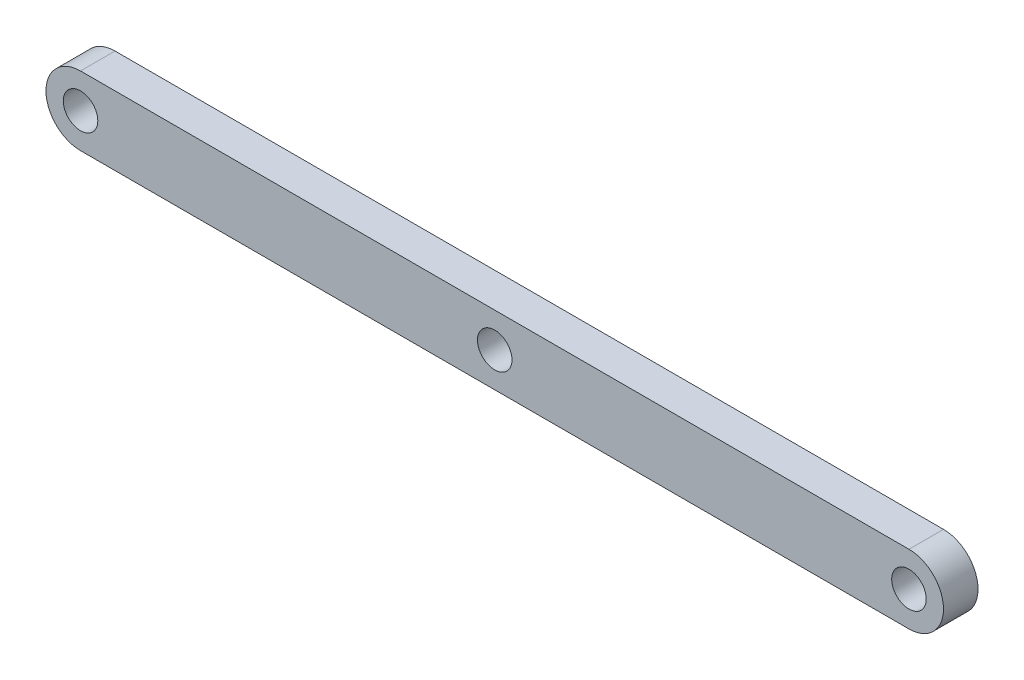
ISO-10303-21;
HEADER;
FILE_DESCRIPTION(('STEP AP214'),'2;1');
FILE_NAME('part.step','',(''),(''),'','','');
FILE_SCHEMA(('AUTOMOTIVE_DESIGN { 1 0 10303 214 1 1 1 1 }'));
ENDSEC;
DATA;
#1=APPLICATION_CONTEXT('core data for automotive mechanical design processes');
#2=APPLICATION_PROTOCOL_DEFINITION('international standard','automotive_design',2000,#1);
#3=PRODUCT_CONTEXT('',#1,'mechanical');
#4=PRODUCT('Part','Part','',(#3));
#5=PRODUCT_RELATED_PRODUCT_CATEGORY('part','',(#4));
#6=PRODUCT_DEFINITION_FORMATION('','',#4);
#7=PRODUCT_DEFINITION_CONTEXT('part definition',#1,'design');
#8=PRODUCT_DEFINITION('design','',#6,#7);
#9=PRODUCT_DEFINITION_SHAPE('','',#8);
#10=(LENGTH_UNIT() NAMED_UNIT(*) SI_UNIT(.MILLI.,.METRE.));
#11=(NAMED_UNIT(*) PLANE_ANGLE_UNIT() SI_UNIT($,.RADIAN.));
#12=(NAMED_UNIT(*) SI_UNIT($,.STERADIAN.) SOLID_ANGLE_UNIT());
#13=UNCERTAINTY_MEASURE_WITH_UNIT(LENGTH_MEASURE(1.E-05),#10,'distance_accuracy_value','');
#14=(GEOMETRIC_REPRESENTATION_CONTEXT(3) GLOBAL_UNCERTAINTY_ASSIGNED_CONTEXT((#13)) GLOBAL_UNIT_ASSIGNED_CONTEXT((#10,
#11,#12)) REPRESENTATION_CONTEXT('',''));
#15=CARTESIAN_POINT('',(0.,0.,0.));
#16=DIRECTION('',(0.,0.,1.));
#17=DIRECTION('',(1.,0.,0.));
#18=AXIS2_PLACEMENT_3D('',#15,#16,#17);
#19=CARTESIAN_POINT('',(0.,0.,3.175));
#20=DIRECTION('',(0.,0.,1.));
#21=DIRECTION('',(1.,0.,0.));
#22=AXIS2_PLACEMENT_3D('',#19,#20,#21);
#23=PLANE('',#22);
#24=CARTESIAN_POINT('',(76.2,0.,3.175));
#25=DIRECTION('',(0.,0.,1.));
#26=DIRECTION('',(1.,0.,0.));
#27=AXIS2_PLACEMENT_3D('',#24,#25,#26);
#28=CIRCLE('',#27,1.5875);
#29=CARTESIAN_POINT('',(77.7875,0.,3.175));
#30=VERTEX_POINT('',#29);
#31=EDGE_CURVE('E115',#30,#30,#28,.T.);
#32=ORIENTED_EDGE('',*,*,#31,.F.);
#33=EDGE_LOOP('',(#32));
#34=FACE_BOUND('',#33,.T.);
#35=CARTESIAN_POINT('',(0.,0.,3.175));
#36=DIRECTION('',(0.,0.,1.));
#37=DIRECTION('',(1.,0.,0.));
#38=AXIS2_PLACEMENT_3D('',#35,#36,#37);
#39=CIRCLE('',#38,3.175);
#40=CARTESIAN_POINT('',(0.,3.175,3.175));
#41=VERTEX_POINT('',#40);
#42=CARTESIAN_POINT('',(0.,-3.175,3.175));
#43=VERTEX_POINT('',#42);
#44=EDGE_CURVE('E85',#41,#43,#39,.T.);
#45=ORIENTED_EDGE('',*,*,#44,.T.);
#46=DIRECTION('',(1.,0.,0.));
#47=VECTOR('',#46,1.);
#48=CARTESIAN_POINT('',(0.,-3.175,3.175));
#49=LINE('',#48,#47);
#50=CARTESIAN_POINT('',(76.2,-3.175,3.175));
#51=VERTEX_POINT('',#50);
#52=EDGE_CURVE('E80',#43,#51,#49,.T.);
#53=ORIENTED_EDGE('',*,*,#52,.T.);
#54=CARTESIAN_POINT('',(76.2,0.,3.175));
#55=DIRECTION('',(0.,0.,1.));
#56=DIRECTION('',(1.,0.,0.));
#57=AXIS2_PLACEMENT_3D('',#54,#55,#56);
#58=CIRCLE('',#57,3.175);
#59=CARTESIAN_POINT('',(76.2,3.175,3.175));
#60=VERTEX_POINT('',#59);
#61=EDGE_CURVE('E83',#51,#60,#58,.T.);
#62=ORIENTED_EDGE('',*,*,#61,.T.);
#63=DIRECTION('',(-1.,0.,0.));
#64=VECTOR('',#63,1.);
#65=CARTESIAN_POINT('',(0.,3.175,3.175));
#66=LINE('',#65,#64);
#67=EDGE_CURVE('E50',#60,#41,#66,.T.);
#68=ORIENTED_EDGE('',*,*,#67,.T.);
#69=EDGE_LOOP('',(#45,#53,#62,#68));
#70=FACE_BOUND('',#69,.T.);
#71=CARTESIAN_POINT('',(0.,0.,3.175));
#72=DIRECTION('',(0.,0.,1.));
#73=DIRECTION('',(1.,0.,0.));
#74=AXIS2_PLACEMENT_3D('',#71,#72,#73);
#75=CIRCLE('',#74,1.5875);
#76=CARTESIAN_POINT('',(1.5875,0.,3.175));
#77=VERTEX_POINT('',#76);
#78=EDGE_CURVE('E100',#77,#77,#75,.T.);
#79=ORIENTED_EDGE('',*,*,#78,.F.);
#80=EDGE_LOOP('',(#79));
#81=FACE_BOUND('',#80,.T.);
#82=CARTESIAN_POINT('',(38.1,0.,3.175));
#83=DIRECTION('',(0.,0.,1.));
#84=DIRECTION('',(1.,0.,0.));
#85=AXIS2_PLACEMENT_3D('',#82,#83,#84);
#86=CIRCLE('',#85,1.5875);
#87=CARTESIAN_POINT('',(39.6875,0.,3.175));
#88=VERTEX_POINT('',#87);
#89=EDGE_CURVE('E121',#88,#88,#86,.T.);
#90=ORIENTED_EDGE('',*,*,#89,.F.);
#91=EDGE_LOOP('',(#90));
#92=FACE_BOUND('',#91,.T.);
#93=ADVANCED_FACE('F33',(#34,#70,#81,#92),#23,.T.);
#94=CARTESIAN_POINT('',(0.,0.,0.));
#95=DIRECTION('',(0.,0.,1.));
#96=DIRECTION('',(1.,0.,0.));
#97=AXIS2_PLACEMENT_3D('',#94,#95,#96);
#98=PLANE('',#97);
#99=CARTESIAN_POINT('',(0.,0.,0.));
#100=DIRECTION('',(0.,0.,1.));
#101=DIRECTION('',(1.,0.,0.));
#102=AXIS2_PLACEMENT_3D('',#99,#100,#101);
#103=CIRCLE('',#102,3.175);
#104=CARTESIAN_POINT('',(0.,3.175,0.));
#105=VERTEX_POINT('',#104);
#106=CARTESIAN_POINT('',(0.,-3.175,0.));
#107=VERTEX_POINT('',#106);
#108=EDGE_CURVE('E97',#105,#107,#103,.T.);
#109=ORIENTED_EDGE('',*,*,#108,.F.);
#110=DIRECTION('',(-1.,0.,0.));
#111=VECTOR('',#110,1.);
#112=CARTESIAN_POINT('',(0.,3.175,0.));
#113=LINE('',#112,#111);
#114=CARTESIAN_POINT('',(76.2,3.175,0.));
#115=VERTEX_POINT('',#114);
#116=EDGE_CURVE('E73',#115,#105,#113,.T.);
#117=ORIENTED_EDGE('',*,*,#116,.F.);
#118=CARTESIAN_POINT('',(76.2,0.,0.));
#119=DIRECTION('',(0.,0.,1.));
#120=DIRECTION('',(1.,0.,0.));
#121=AXIS2_PLACEMENT_3D('',#118,#119,#120);
#122=CIRCLE('',#121,3.175);
#123=CARTESIAN_POINT('',(76.2,-3.175,0.));
#124=VERTEX_POINT('',#123);
#125=EDGE_CURVE('E67',#124,#115,#122,.T.);
#126=ORIENTED_EDGE('',*,*,#125,.F.);
#127=DIRECTION('',(1.,0.,0.));
#128=VECTOR('',#127,1.);
#129=CARTESIAN_POINT('',(0.,-3.175,0.));
#130=LINE('',#129,#128);
#131=EDGE_CURVE('E89',#107,#124,#130,.T.);
#132=ORIENTED_EDGE('',*,*,#131,.F.);
#133=EDGE_LOOP('',(#109,#117,#126,#132));
#134=FACE_BOUND('',#133,.T.);
#135=CARTESIAN_POINT('',(0.,0.,0.));
#136=DIRECTION('',(0.,0.,1.));
#137=DIRECTION('',(1.,0.,0.));
#138=AXIS2_PLACEMENT_3D('',#135,#136,#137);
#139=CIRCLE('',#138,1.5875);
#140=CARTESIAN_POINT('',(1.5875,0.,0.));
#141=VERTEX_POINT('',#140);
#142=EDGE_CURVE('E112',#141,#141,#139,.T.);
#143=ORIENTED_EDGE('',*,*,#142,.T.);
#144=EDGE_LOOP('',(#143));
#145=FACE_BOUND('',#144,.T.);
#146=CARTESIAN_POINT('',(76.2,0.,0.));
#147=DIRECTION('',(0.,0.,1.));
#148=DIRECTION('',(1.,0.,0.));
#149=AXIS2_PLACEMENT_3D('',#146,#147,#148);
#150=CIRCLE('',#149,1.5875);
#151=CARTESIAN_POINT('',(77.7875,0.,0.));
#152=VERTEX_POINT('',#151);
#153=EDGE_CURVE('E118',#152,#152,#150,.T.);
#154=ORIENTED_EDGE('',*,*,#153,.T.);
#155=EDGE_LOOP('',(#154));
#156=FACE_BOUND('',#155,.T.);
#157=CARTESIAN_POINT('',(38.1,0.,0.));
#158=DIRECTION('',(0.,0.,1.));
#159=DIRECTION('',(1.,0.,0.));
#160=AXIS2_PLACEMENT_3D('',#157,#158,#159);
#161=CIRCLE('',#160,1.5875);
#162=CARTESIAN_POINT('',(39.6875,0.,0.));
#163=VERTEX_POINT('',#162);
#164=EDGE_CURVE('E124',#163,#163,#161,.T.);
#165=ORIENTED_EDGE('',*,*,#164,.T.);
#166=EDGE_LOOP('',(#165));
#167=FACE_BOUND('',#166,.T.);
#168=ADVANCED_FACE('F108',(#134,#145,#156,#167),#98,.F.);
#169=CARTESIAN_POINT('',(0.,0.,3.175));
#170=DIRECTION('',(0.,0.,-1.));
#171=DIRECTION('',(-1.,0.,0.));
#172=AXIS2_PLACEMENT_3D('',#169,#170,#171);
#173=CYLINDRICAL_SURFACE('',#172,3.175);
#174=ORIENTED_EDGE('',*,*,#108,.T.);
#175=DIRECTION('',(0.,0.,-1.));
#176=VECTOR('',#175,1.);
#177=CARTESIAN_POINT('',(0.,-3.175,3.175));
#178=LINE('',#177,#176);
#179=EDGE_CURVE('E11',#43,#107,#178,.T.);
#180=ORIENTED_EDGE('',*,*,#179,.F.);
#181=ORIENTED_EDGE('',*,*,#44,.F.);
#182=DIRECTION('',(0.,0.,-1.));
#183=VECTOR('',#182,1.);
#184=CARTESIAN_POINT('',(0.,3.175,3.175));
#185=LINE('',#184,#183);
#186=EDGE_CURVE('E93',#41,#105,#185,.T.);
#187=ORIENTED_EDGE('',*,*,#186,.T.);
#188=EDGE_LOOP('',(#174,#180,#181,#187));
#189=FACE_BOUND('',#188,.T.);
#190=ADVANCED_FACE('F35',(#189),#173,.T.);
#191=CARTESIAN_POINT('',(0.,-3.175,3.175));
#192=DIRECTION('',(0.,1.,0.));
#193=DIRECTION('',(0.,0.,1.));
#194=AXIS2_PLACEMENT_3D('',#191,#192,#193);
#195=PLANE('',#194);
#196=ORIENTED_EDGE('',*,*,#131,.T.);
#197=DIRECTION('',(0.,0.,-1.));
#198=VECTOR('',#197,1.);
#199=CARTESIAN_POINT('',(76.2,-3.175,3.175));
#200=LINE('',#199,#198);
#201=EDGE_CURVE('E42',#51,#124,#200,.T.);
#202=ORIENTED_EDGE('',*,*,#201,.F.);
#203=ORIENTED_EDGE('',*,*,#52,.F.);
#204=ORIENTED_EDGE('',*,*,#179,.T.);
#205=EDGE_LOOP('',(#196,#202,#203,#204));
#206=FACE_BOUND('',#205,.T.);
#207=ADVANCED_FACE('F88',(#206),#195,.F.);
#208=CARTESIAN_POINT('',(76.2,0.,3.175));
#209=DIRECTION('',(0.,0.,-1.));
#210=DIRECTION('',(-1.,0.,0.));
#211=AXIS2_PLACEMENT_3D('',#208,#209,#210);
#212=CYLINDRICAL_SURFACE('',#211,3.175);
#213=ORIENTED_EDGE('',*,*,#125,.T.);
#214=DIRECTION('',(0.,0.,-1.));
#215=VECTOR('',#214,1.);
#216=CARTESIAN_POINT('',(76.2,3.175,3.175));
#217=LINE('',#216,#215);
#218=EDGE_CURVE('E90',#60,#115,#217,.T.);
#219=ORIENTED_EDGE('',*,*,#218,.F.);
#220=ORIENTED_EDGE('',*,*,#61,.F.);
#221=ORIENTED_EDGE('',*,*,#201,.T.);
#222=EDGE_LOOP('',(#213,#219,#220,#221));
#223=FACE_BOUND('',#222,.T.);
#224=ADVANCED_FACE('F91',(#223),#212,.T.);
#225=CARTESIAN_POINT('',(0.,3.175,3.175));
#226=DIRECTION('',(0.,-1.,0.));
#227=DIRECTION('',(0.,0.,-1.));
#228=AXIS2_PLACEMENT_3D('',#225,#226,#227);
#229=PLANE('',#228);
#230=ORIENTED_EDGE('',*,*,#116,.T.);
#231=ORIENTED_EDGE('',*,*,#186,.F.);
#232=ORIENTED_EDGE('',*,*,#67,.F.);
#233=ORIENTED_EDGE('',*,*,#218,.T.);
#234=EDGE_LOOP('',(#230,#231,#232,#233));
#235=FACE_BOUND('',#234,.T.);
#236=ADVANCED_FACE('F105',(#235),#229,.F.);
#237=CARTESIAN_POINT('',(0.,0.,3.175));
#238=DIRECTION('',(0.,0.,-1.));
#239=DIRECTION('',(-1.,0.,0.));
#240=AXIS2_PLACEMENT_3D('',#237,#238,#239);
#241=CYLINDRICAL_SURFACE('',#240,1.5875);
#242=ORIENTED_EDGE('',*,*,#78,.T.);
#243=EDGE_LOOP('',(#242));
#244=FACE_BOUND('',#243,.T.);
#245=ORIENTED_EDGE('',*,*,#142,.F.);
#246=EDGE_LOOP('',(#245));
#247=FACE_BOUND('',#246,.T.);
#248=ADVANCED_FACE('F142',(#244,#247),#241,.F.);
#249=CARTESIAN_POINT('',(76.2,0.,3.175));
#250=DIRECTION('',(0.,0.,-1.));
#251=DIRECTION('',(-1.,0.,0.));
#252=AXIS2_PLACEMENT_3D('',#249,#250,#251);
#253=CYLINDRICAL_SURFACE('',#252,1.5875);
#254=ORIENTED_EDGE('',*,*,#31,.T.);
#255=EDGE_LOOP('',(#254));
#256=FACE_BOUND('',#255,.T.);
#257=ORIENTED_EDGE('',*,*,#153,.F.);
#258=EDGE_LOOP('',(#257));
#259=FACE_BOUND('',#258,.T.);
#260=ADVANCED_FACE('F188',(#256,#259),#253,.F.);
#261=CARTESIAN_POINT('',(38.1,0.,3.175));
#262=DIRECTION('',(0.,0.,-1.));
#263=DIRECTION('',(-1.,0.,0.));
#264=AXIS2_PLACEMENT_3D('',#261,#262,#263);
#265=CYLINDRICAL_SURFACE('',#264,1.5875);
#266=ORIENTED_EDGE('',*,*,#89,.T.);
#267=EDGE_LOOP('',(#266));
#268=FACE_BOUND('',#267,.T.);
#269=ORIENTED_EDGE('',*,*,#164,.F.);
#270=EDGE_LOOP('',(#269));
#271=FACE_BOUND('',#270,.T.);
#272=ADVANCED_FACE('F130',(#268,#271),#265,.F.);
#273=CLOSED_SHELL('',(#93,#168,#190,#207,#224,#236,#248,#260,#272));
#274=MANIFOLD_SOLID_BREP('B2',#273);
#275=ADVANCED_BREP_SHAPE_REPRESENTATION('',(#18,#274),#14);
#276=SHAPE_DEFINITION_REPRESENTATION(#9,#275);
ENDSEC;
END-ISO-10303-21;
